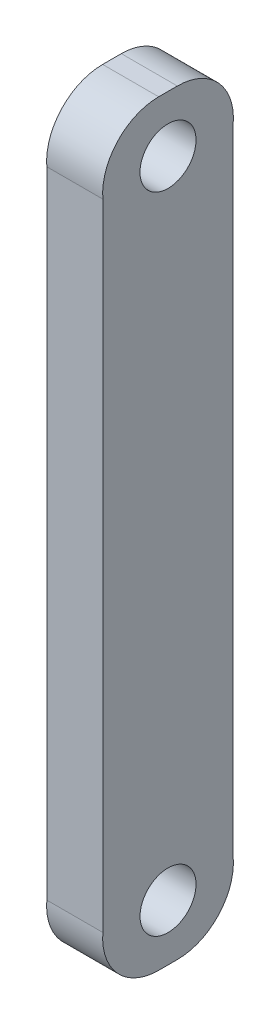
ISO-10303-21;
HEADER;
FILE_DESCRIPTION(('STEP AP214'),'2;1');
FILE_NAME('part.step','',(''),(''),'','','');
FILE_SCHEMA(('AUTOMOTIVE_DESIGN { 1 0 10303 214 1 1 1 1 }'));
ENDSEC;
DATA;
#1=APPLICATION_CONTEXT('core data for automotive mechanical design processes');
#2=APPLICATION_PROTOCOL_DEFINITION('international standard','automotive_design',2000,#1);
#3=PRODUCT_CONTEXT('',#1,'mechanical');
#4=PRODUCT('Part','Part','',(#3));
#5=PRODUCT_RELATED_PRODUCT_CATEGORY('part','',(#4));
#6=PRODUCT_DEFINITION_FORMATION('','',#4);
#7=PRODUCT_DEFINITION_CONTEXT('part definition',#1,'design');
#8=PRODUCT_DEFINITION('design','',#6,#7);
#9=PRODUCT_DEFINITION_SHAPE('','',#8);
#10=(LENGTH_UNIT() NAMED_UNIT(*) SI_UNIT(.MILLI.,.METRE.));
#11=(NAMED_UNIT(*) PLANE_ANGLE_UNIT() SI_UNIT($,.RADIAN.));
#12=(NAMED_UNIT(*) SI_UNIT($,.STERADIAN.) SOLID_ANGLE_UNIT());
#13=UNCERTAINTY_MEASURE_WITH_UNIT(LENGTH_MEASURE(1.E-05),#10,'distance_accuracy_value','');
#14=(GEOMETRIC_REPRESENTATION_CONTEXT(3) GLOBAL_UNCERTAINTY_ASSIGNED_CONTEXT((#13)) GLOBAL_UNIT_ASSIGNED_CONTEXT((#10,
#11,#12)) REPRESENTATION_CONTEXT('',''));
#15=CARTESIAN_POINT('',(0.,0.,0.));
#16=DIRECTION('',(0.,0.,1.));
#17=DIRECTION('',(1.,0.,0.));
#18=AXIS2_PLACEMENT_3D('',#15,#16,#17);
#19=CARTESIAN_POINT('',(3.,0.,0.5));
#20=DIRECTION('',(1.,0.,0.));
#21=DIRECTION('',(0.,0.,-1.));
#22=AXIS2_PLACEMENT_3D('',#19,#20,#21);
#23=PLANE('',#22);
#24=CARTESIAN_POINT('',(3.,0.,0.));
#25=DIRECTION('',(1.,0.,0.));
#26=DIRECTION('',(0.,0.,-1.));
#27=AXIS2_PLACEMENT_3D('',#24,#25,#26);
#28=CIRCLE('',#27,1.5);
#29=CARTESIAN_POINT('',(3.,0.,-1.5));
#30=VERTEX_POINT('',#29);
#31=EDGE_CURVE('E142',#30,#30,#28,.T.);
#32=ORIENTED_EDGE('',*,*,#31,.F.);
#33=EDGE_LOOP('',(#32));
#34=FACE_BOUND('',#33,.T.);
#35=CARTESIAN_POINT('',(3.,0.,0.5));
#36=DIRECTION('',(1.,0.,0.));
#37=DIRECTION('',(0.,0.,-1.));
#38=AXIS2_PLACEMENT_3D('',#35,#36,#37);
#39=CIRCLE('',#38,3.);
#40=CARTESIAN_POINT('',(3.,0.25087878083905,3.48949156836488));
#41=VERTEX_POINT('',#40);
#42=CARTESIAN_POINT('',(3.,-3.,0.499999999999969));
#43=VERTEX_POINT('',#42);
#44=EDGE_CURVE('E153',#41,#43,#39,.T.);
#45=ORIENTED_EDGE('',*,*,#44,.T.);
#46=DIRECTION('',(0.,0.,-1.));
#47=VECTOR('',#46,1.);
#48=CARTESIAN_POINT('',(3.,-3.,0.499999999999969));
#49=LINE('',#48,#47);
#50=CARTESIAN_POINT('',(3.,-3.,-0.500000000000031));
#51=VERTEX_POINT('',#50);
#52=EDGE_CURVE('E101',#43,#51,#49,.T.);
#53=ORIENTED_EDGE('',*,*,#52,.T.);
#54=CARTESIAN_POINT('',(3.,0.,-0.5));
#55=DIRECTION('',(1.,0.,0.));
#56=DIRECTION('',(0.,0.,-1.));
#57=AXIS2_PLACEMENT_3D('',#54,#55,#56);
#58=CIRCLE('',#57,3.);
#59=CARTESIAN_POINT('',(3.,0.250878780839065,-3.48949156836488));
#60=VERTEX_POINT('',#59);
#61=EDGE_CURVE('E168',#51,#60,#58,.T.);
#62=ORIENTED_EDGE('',*,*,#61,.T.);
#63=DIRECTION('',(0.,1.,0.));
#64=VECTOR('',#63,1.);
#65=CARTESIAN_POINT('',(3.,0.250878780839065,-3.48949156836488));
#66=LINE('',#65,#64);
#67=CARTESIAN_POINT('',(3.,34.2508787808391,-3.48949156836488));
#68=VERTEX_POINT('',#67);
#69=EDGE_CURVE('E181',#60,#68,#66,.T.);
#70=ORIENTED_EDGE('',*,*,#69,.T.);
#71=CARTESIAN_POINT('',(3.,34.5017575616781,-0.499999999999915));
#72=DIRECTION('',(1.,0.,0.));
#73=DIRECTION('',(0.,0.,1.));
#74=AXIS2_PLACEMENT_3D('',#71,#72,#73);
#75=CIRCLE('',#74,3.00000000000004);
#76=CARTESIAN_POINT('',(3.,37.5017575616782,-0.499999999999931));
#77=VERTEX_POINT('',#76);
#78=EDGE_CURVE('E120',#68,#77,#75,.T.);
#79=ORIENTED_EDGE('',*,*,#78,.T.);
#80=DIRECTION('',(0.,0.,1.));
#81=VECTOR('',#80,1.);
#82=CARTESIAN_POINT('',(3.,37.5017575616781,0.500000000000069));
#83=LINE('',#82,#81);
#84=CARTESIAN_POINT('',(3.,37.5017575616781,0.500000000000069));
#85=VERTEX_POINT('',#84);
#86=EDGE_CURVE('E114',#77,#85,#83,.T.);
#87=ORIENTED_EDGE('',*,*,#86,.T.);
#88=CARTESIAN_POINT('',(3.,34.5017575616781,0.500000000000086));
#89=DIRECTION('',(1.,0.,0.));
#90=DIRECTION('',(0.,0.,1.));
#91=AXIS2_PLACEMENT_3D('',#88,#89,#90);
#92=CIRCLE('',#91,2.99999999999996);
#93=CARTESIAN_POINT('',(3.,34.2508787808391,3.48949156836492));
#94=VERTEX_POINT('',#93);
#95=EDGE_CURVE('E118',#85,#94,#92,.T.);
#96=ORIENTED_EDGE('',*,*,#95,.T.);
#97=DIRECTION('',(0.,-1.,0.));
#98=VECTOR('',#97,1.);
#99=CARTESIAN_POINT('',(3.,0.25087878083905,3.48949156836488));
#100=LINE('',#99,#98);
#101=EDGE_CURVE('E58',#94,#41,#100,.T.);
#102=ORIENTED_EDGE('',*,*,#101,.T.);
#103=EDGE_LOOP('',(#45,#53,#62,#70,#79,#87,#96,#102));
#104=FACE_BOUND('',#103,.T.);
#105=CARTESIAN_POINT('',(3.,34.5017575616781,0.));
#106=DIRECTION('',(1.,0.,0.));
#107=DIRECTION('',(0.,0.,1.));
#108=AXIS2_PLACEMENT_3D('',#105,#106,#107);
#109=CIRCLE('',#108,1.5);
#110=CARTESIAN_POINT('',(3.,34.5017575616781,1.50000000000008));
#111=VERTEX_POINT('',#110);
#112=EDGE_CURVE('E190',#111,#111,#109,.T.);
#113=ORIENTED_EDGE('',*,*,#112,.F.);
#114=EDGE_LOOP('',(#113));
#115=FACE_BOUND('',#114,.T.);
#116=ADVANCED_FACE('F41',(#34,#104,#115),#23,.T.);
#117=CARTESIAN_POINT('',(0.,0.,0.5));
#118=DIRECTION('',(1.,0.,0.));
#119=DIRECTION('',(0.,0.,-1.));
#120=AXIS2_PLACEMENT_3D('',#117,#118,#119);
#121=PLANE('',#120);
#122=CARTESIAN_POINT('',(0.,0.,0.5));
#123=DIRECTION('',(1.,0.,0.));
#124=DIRECTION('',(0.,0.,-1.));
#125=AXIS2_PLACEMENT_3D('',#122,#123,#124);
#126=CIRCLE('',#125,3.);
#127=CARTESIAN_POINT('',(0.,0.25087878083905,3.48949156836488));
#128=VERTEX_POINT('',#127);
#129=CARTESIAN_POINT('',(0.,-3.,0.499999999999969));
#130=VERTEX_POINT('',#129);
#131=EDGE_CURVE('E138',#128,#130,#126,.T.);
#132=ORIENTED_EDGE('',*,*,#131,.F.);
#133=DIRECTION('',(0.,-1.,0.));
#134=VECTOR('',#133,1.);
#135=CARTESIAN_POINT('',(0.,0.25087878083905,3.48949156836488));
#136=LINE('',#135,#134);
#137=CARTESIAN_POINT('',(0.,34.2508787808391,3.48949156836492));
#138=VERTEX_POINT('',#137);
#139=EDGE_CURVE('E93',#138,#128,#136,.T.);
#140=ORIENTED_EDGE('',*,*,#139,.F.);
#141=CARTESIAN_POINT('',(0.,34.5017575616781,0.500000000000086));
#142=DIRECTION('',(1.,0.,0.));
#143=DIRECTION('',(0.,0.,1.));
#144=AXIS2_PLACEMENT_3D('',#141,#142,#143);
#145=CIRCLE('',#144,2.99999999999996);
#146=CARTESIAN_POINT('',(0.,37.5017575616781,0.500000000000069));
#147=VERTEX_POINT('',#146);
#148=EDGE_CURVE('E87',#147,#138,#145,.T.);
#149=ORIENTED_EDGE('',*,*,#148,.F.);
#150=DIRECTION('',(0.,0.,1.));
#151=VECTOR('',#150,1.);
#152=CARTESIAN_POINT('',(0.,37.5017575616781,0.500000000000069));
#153=LINE('',#152,#151);
#154=CARTESIAN_POINT('',(0.,37.5017575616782,-0.499999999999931));
#155=VERTEX_POINT('',#154);
#156=EDGE_CURVE('E128',#155,#147,#153,.T.);
#157=ORIENTED_EDGE('',*,*,#156,.F.);
#158=CARTESIAN_POINT('',(0.,34.5017575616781,-0.499999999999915));
#159=DIRECTION('',(1.,0.,0.));
#160=DIRECTION('',(0.,0.,1.));
#161=AXIS2_PLACEMENT_3D('',#158,#159,#160);
#162=CIRCLE('',#161,3.00000000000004);
#163=CARTESIAN_POINT('',(0.,34.2508787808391,-3.48949156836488));
#164=VERTEX_POINT('',#163);
#165=EDGE_CURVE('E148',#164,#155,#162,.T.);
#166=ORIENTED_EDGE('',*,*,#165,.F.);
#167=DIRECTION('',(0.,1.,0.));
#168=VECTOR('',#167,1.);
#169=CARTESIAN_POINT('',(0.,0.250878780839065,-3.48949156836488));
#170=LINE('',#169,#168);
#171=CARTESIAN_POINT('',(0.,0.250878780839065,-3.48949156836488));
#172=VERTEX_POINT('',#171);
#173=EDGE_CURVE('E146',#172,#164,#170,.T.);
#174=ORIENTED_EDGE('',*,*,#173,.F.);
#175=CARTESIAN_POINT('',(0.,0.,-0.5));
#176=DIRECTION('',(1.,0.,0.));
#177=DIRECTION('',(0.,0.,-1.));
#178=AXIS2_PLACEMENT_3D('',#175,#176,#177);
#179=CIRCLE('',#178,3.);
#180=CARTESIAN_POINT('',(0.,-3.,-0.500000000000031));
#181=VERTEX_POINT('',#180);
#182=EDGE_CURVE('E144',#181,#172,#179,.T.);
#183=ORIENTED_EDGE('',*,*,#182,.F.);
#184=DIRECTION('',(0.,0.,-1.));
#185=VECTOR('',#184,1.);
#186=CARTESIAN_POINT('',(0.,-3.,0.499999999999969));
#187=LINE('',#186,#185);
#188=EDGE_CURVE('E141',#130,#181,#187,.T.);
#189=ORIENTED_EDGE('',*,*,#188,.F.);
#190=EDGE_LOOP('',(#132,#140,#149,#157,#166,#174,#183,#189));
#191=FACE_BOUND('',#190,.T.);
#192=CARTESIAN_POINT('',(0.,0.,0.));
#193=DIRECTION('',(1.,0.,0.));
#194=DIRECTION('',(0.,0.,-1.));
#195=AXIS2_PLACEMENT_3D('',#192,#193,#194);
#196=CIRCLE('',#195,1.5);
#197=CARTESIAN_POINT('',(0.,0.,-1.5));
#198=VERTEX_POINT('',#197);
#199=EDGE_CURVE('E187',#198,#198,#196,.T.);
#200=ORIENTED_EDGE('',*,*,#199,.T.);
#201=EDGE_LOOP('',(#200));
#202=FACE_BOUND('',#201,.T.);
#203=CARTESIAN_POINT('',(0.,34.5017575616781,0.));
#204=DIRECTION('',(1.,0.,0.));
#205=DIRECTION('',(0.,0.,1.));
#206=AXIS2_PLACEMENT_3D('',#203,#204,#205);
#207=CIRCLE('',#206,1.5);
#208=CARTESIAN_POINT('',(0.,34.5017575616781,1.50000000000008));
#209=VERTEX_POINT('',#208);
#210=EDGE_CURVE('E193',#209,#209,#207,.T.);
#211=ORIENTED_EDGE('',*,*,#210,.T.);
#212=EDGE_LOOP('',(#211));
#213=FACE_BOUND('',#212,.T.);
#214=ADVANCED_FACE('F172',(#191,#202,#213),#121,.F.);
#215=CARTESIAN_POINT('',(3.,0.,0.5));
#216=DIRECTION('',(-1.,0.,0.));
#217=DIRECTION('',(0.,0.,1.));
#218=AXIS2_PLACEMENT_3D('',#215,#216,#217);
#219=CYLINDRICAL_SURFACE('',#218,3.);
#220=ORIENTED_EDGE('',*,*,#131,.T.);
#221=DIRECTION('',(-1.,0.,0.));
#222=VECTOR('',#221,1.);
#223=CARTESIAN_POINT('',(3.,-3.,0.499999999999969));
#224=LINE('',#223,#222);
#225=EDGE_CURVE('E11',#43,#130,#224,.T.);
#226=ORIENTED_EDGE('',*,*,#225,.F.);
#227=ORIENTED_EDGE('',*,*,#44,.F.);
#228=DIRECTION('',(-1.,0.,0.));
#229=VECTOR('',#228,1.);
#230=CARTESIAN_POINT('',(3.,0.25087878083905,3.48949156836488));
#231=LINE('',#230,#229);
#232=EDGE_CURVE('E134',#41,#128,#231,.T.);
#233=ORIENTED_EDGE('',*,*,#232,.T.);
#234=EDGE_LOOP('',(#220,#226,#227,#233));
#235=FACE_BOUND('',#234,.T.);
#236=ADVANCED_FACE('F43',(#235),#219,.T.);
#237=CARTESIAN_POINT('',(3.,-3.,0.499999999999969));
#238=DIRECTION('',(0.,1.,0.));
#239=DIRECTION('',(0.,0.,1.));
#240=AXIS2_PLACEMENT_3D('',#237,#238,#239);
#241=PLANE('',#240);
#242=ORIENTED_EDGE('',*,*,#188,.T.);
#243=DIRECTION('',(-1.,0.,0.));
#244=VECTOR('',#243,1.);
#245=CARTESIAN_POINT('',(3.,-3.,-0.500000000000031));
#246=LINE('',#245,#244);
#247=EDGE_CURVE('E50',#51,#181,#246,.T.);
#248=ORIENTED_EDGE('',*,*,#247,.F.);
#249=ORIENTED_EDGE('',*,*,#52,.F.);
#250=ORIENTED_EDGE('',*,*,#225,.T.);
#251=EDGE_LOOP('',(#242,#248,#249,#250));
#252=FACE_BOUND('',#251,.T.);
#253=ADVANCED_FACE('F225',(#252),#241,.F.);
#254=CARTESIAN_POINT('',(3.,0.,-0.5));
#255=DIRECTION('',(-1.,0.,0.));
#256=DIRECTION('',(0.,0.,1.));
#257=AXIS2_PLACEMENT_3D('',#254,#255,#256);
#258=CYLINDRICAL_SURFACE('',#257,3.);
#259=ORIENTED_EDGE('',*,*,#182,.T.);
#260=DIRECTION('',(-1.,0.,0.));
#261=VECTOR('',#260,1.);
#262=CARTESIAN_POINT('',(3.,0.250878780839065,-3.48949156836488));
#263=LINE('',#262,#261);
#264=EDGE_CURVE('E160',#60,#172,#263,.T.);
#265=ORIENTED_EDGE('',*,*,#264,.F.);
#266=ORIENTED_EDGE('',*,*,#61,.F.);
#267=ORIENTED_EDGE('',*,*,#247,.T.);
#268=EDGE_LOOP('',(#259,#265,#266,#267));
#269=FACE_BOUND('',#268,.T.);
#270=ADVANCED_FACE('F166',(#269),#258,.T.);
#271=CARTESIAN_POINT('',(3.,0.250878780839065,-3.48949156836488));
#272=DIRECTION('',(0.,0.,1.));
#273=DIRECTION('',(1.,0.,0.));
#274=AXIS2_PLACEMENT_3D('',#271,#272,#273);
#275=PLANE('',#274);
#276=ORIENTED_EDGE('',*,*,#173,.T.);
#277=DIRECTION('',(-1.,0.,0.));
#278=VECTOR('',#277,1.);
#279=CARTESIAN_POINT('',(3.,34.2508787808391,-3.48949156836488));
#280=LINE('',#279,#278);
#281=EDGE_CURVE('E157',#68,#164,#280,.T.);
#282=ORIENTED_EDGE('',*,*,#281,.F.);
#283=ORIENTED_EDGE('',*,*,#69,.F.);
#284=ORIENTED_EDGE('',*,*,#264,.T.);
#285=EDGE_LOOP('',(#276,#282,#283,#284));
#286=FACE_BOUND('',#285,.T.);
#287=ADVANCED_FACE('F177',(#286),#275,.F.);
#288=CARTESIAN_POINT('',(3.,34.5017575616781,-0.499999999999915));
#289=DIRECTION('',(-1.,0.,0.));
#290=DIRECTION('',(0.,0.,1.));
#291=AXIS2_PLACEMENT_3D('',#288,#289,#290);
#292=CYLINDRICAL_SURFACE('',#291,3.00000000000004);
#293=ORIENTED_EDGE('',*,*,#165,.T.);
#294=DIRECTION('',(-1.,0.,0.));
#295=VECTOR('',#294,1.);
#296=CARTESIAN_POINT('',(3.,37.5017575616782,-0.499999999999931));
#297=LINE('',#296,#295);
#298=EDGE_CURVE('E129',#77,#155,#297,.T.);
#299=ORIENTED_EDGE('',*,*,#298,.F.);
#300=ORIENTED_EDGE('',*,*,#78,.F.);
#301=ORIENTED_EDGE('',*,*,#281,.T.);
#302=EDGE_LOOP('',(#293,#299,#300,#301));
#303=FACE_BOUND('',#302,.T.);
#304=ADVANCED_FACE('F180',(#303),#292,.T.);
#305=CARTESIAN_POINT('',(3.,37.5017575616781,0.500000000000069));
#306=DIRECTION('',(0.,-1.,0.));
#307=DIRECTION('',(0.,0.,-1.));
#308=AXIS2_PLACEMENT_3D('',#305,#306,#307);
#309=PLANE('',#308);
#310=ORIENTED_EDGE('',*,*,#156,.T.);
#311=DIRECTION('',(-1.,0.,0.));
#312=VECTOR('',#311,1.);
#313=CARTESIAN_POINT('',(3.,37.5017575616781,0.500000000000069));
#314=LINE('',#313,#312);
#315=EDGE_CURVE('E125',#85,#147,#314,.T.);
#316=ORIENTED_EDGE('',*,*,#315,.F.);
#317=ORIENTED_EDGE('',*,*,#86,.F.);
#318=ORIENTED_EDGE('',*,*,#298,.T.);
#319=EDGE_LOOP('',(#310,#316,#317,#318));
#320=FACE_BOUND('',#319,.T.);
#321=ADVANCED_FACE('F126',(#320),#309,.F.);
#322=CARTESIAN_POINT('',(3.,34.5017575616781,0.500000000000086));
#323=DIRECTION('',(-1.,0.,0.));
#324=DIRECTION('',(0.,0.,1.));
#325=AXIS2_PLACEMENT_3D('',#322,#323,#324);
#326=CYLINDRICAL_SURFACE('',#325,2.99999999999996);
#327=ORIENTED_EDGE('',*,*,#148,.T.);
#328=DIRECTION('',(-1.,0.,0.));
#329=VECTOR('',#328,1.);
#330=CARTESIAN_POINT('',(3.,34.2508787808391,3.48949156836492));
#331=LINE('',#330,#329);
#332=EDGE_CURVE('E130',#94,#138,#331,.T.);
#333=ORIENTED_EDGE('',*,*,#332,.F.);
#334=ORIENTED_EDGE('',*,*,#95,.F.);
#335=ORIENTED_EDGE('',*,*,#315,.T.);
#336=EDGE_LOOP('',(#327,#333,#334,#335));
#337=FACE_BOUND('',#336,.T.);
#338=ADVANCED_FACE('F132',(#337),#326,.T.);
#339=CARTESIAN_POINT('',(3.,0.25087878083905,3.48949156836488));
#340=DIRECTION('',(0.,0.,-1.));
#341=DIRECTION('',(-1.,0.,0.));
#342=AXIS2_PLACEMENT_3D('',#339,#340,#341);
#343=PLANE('',#342);
#344=ORIENTED_EDGE('',*,*,#139,.T.);
#345=ORIENTED_EDGE('',*,*,#232,.F.);
#346=ORIENTED_EDGE('',*,*,#101,.F.);
#347=ORIENTED_EDGE('',*,*,#332,.T.);
#348=EDGE_LOOP('',(#344,#345,#346,#347));
#349=FACE_BOUND('',#348,.T.);
#350=ADVANCED_FACE('F213',(#349),#343,.F.);
#351=CARTESIAN_POINT('',(3.,0.,0.));
#352=DIRECTION('',(-1.,0.,0.));
#353=DIRECTION('',(0.,0.,1.));
#354=AXIS2_PLACEMENT_3D('',#351,#352,#353);
#355=CYLINDRICAL_SURFACE('',#354,1.5);
#356=ORIENTED_EDGE('',*,*,#31,.T.);
#357=EDGE_LOOP('',(#356));
#358=FACE_BOUND('',#357,.T.);
#359=ORIENTED_EDGE('',*,*,#199,.F.);
#360=EDGE_LOOP('',(#359));
#361=FACE_BOUND('',#360,.T.);
#362=ADVANCED_FACE('F210',(#358,#361),#355,.F.);
#363=CARTESIAN_POINT('',(3.,34.5017575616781,0.));
#364=DIRECTION('',(-1.,0.,0.));
#365=DIRECTION('',(0.,0.,1.));
#366=AXIS2_PLACEMENT_3D('',#363,#364,#365);
#367=CYLINDRICAL_SURFACE('',#366,1.5);
#368=ORIENTED_EDGE('',*,*,#112,.T.);
#369=EDGE_LOOP('',(#368));
#370=FACE_BOUND('',#369,.T.);
#371=ORIENTED_EDGE('',*,*,#210,.F.);
#372=EDGE_LOOP('',(#371));
#373=FACE_BOUND('',#372,.T.);
#374=ADVANCED_FACE('F199',(#370,#373),#367,.F.);
#375=CLOSED_SHELL('',(#116,#214,#236,#253,#270,#287,#304,#321,#338,#350,#362,#374));
#376=MANIFOLD_SOLID_BREP('B2',#375);
#377=ADVANCED_BREP_SHAPE_REPRESENTATION('',(#18,#376),#14);
#378=SHAPE_DEFINITION_REPRESENTATION(#9,#377);
ENDSEC;
END-ISO-10303-21;
